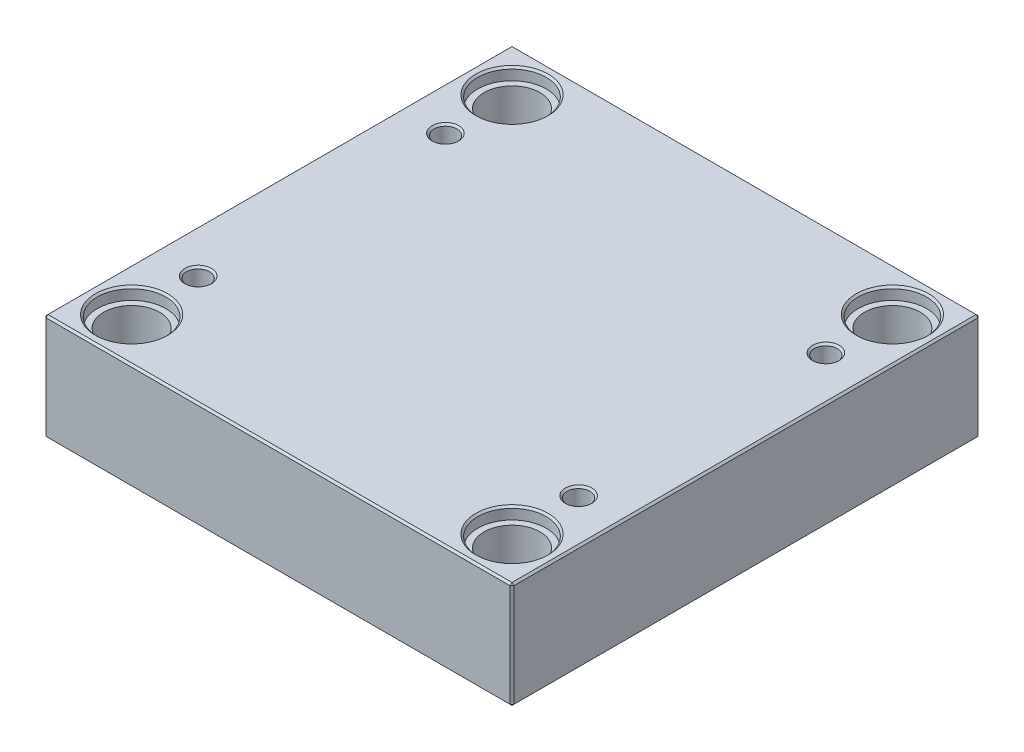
ISO-10303-21;
HEADER;
FILE_DESCRIPTION(('STEP AP214'),'2;1');
FILE_NAME('part.step','',(''),(''),'','','');
FILE_SCHEMA(('AUTOMOTIVE_DESIGN { 1 0 10303 214 1 1 1 1 }'));
ENDSEC;
DATA;
#1=APPLICATION_CONTEXT('core data for automotive mechanical design processes');
#2=APPLICATION_PROTOCOL_DEFINITION('international standard','automotive_design',2000,#1);
#3=PRODUCT_CONTEXT('',#1,'mechanical');
#4=PRODUCT('Part','Part','',(#3));
#5=PRODUCT_RELATED_PRODUCT_CATEGORY('part','',(#4));
#6=PRODUCT_DEFINITION_FORMATION('','',#4);
#7=PRODUCT_DEFINITION_CONTEXT('part definition',#1,'design');
#8=PRODUCT_DEFINITION('design','',#6,#7);
#9=PRODUCT_DEFINITION_SHAPE('','',#8);
#10=(LENGTH_UNIT() NAMED_UNIT(*) SI_UNIT(.MILLI.,.METRE.));
#11=(NAMED_UNIT(*) PLANE_ANGLE_UNIT() SI_UNIT($,.RADIAN.));
#12=(NAMED_UNIT(*) SI_UNIT($,.STERADIAN.) SOLID_ANGLE_UNIT());
#13=UNCERTAINTY_MEASURE_WITH_UNIT(LENGTH_MEASURE(1.E-05),#10,'distance_accuracy_value','');
#14=(GEOMETRIC_REPRESENTATION_CONTEXT(3) GLOBAL_UNCERTAINTY_ASSIGNED_CONTEXT((#13)) GLOBAL_UNIT_ASSIGNED_CONTEXT((#10,
#11,#12)) REPRESENTATION_CONTEXT('',''));
#15=CARTESIAN_POINT('',(0.,0.,0.));
#16=DIRECTION('',(0.,0.,1.));
#17=DIRECTION('',(1.,0.,0.));
#18=AXIS2_PLACEMENT_3D('',#15,#16,#17);
#19=CARTESIAN_POINT('',(-100.,0.,-100.));
#20=DIRECTION('',(0.,1.,0.));
#21=DIRECTION('',(0.,0.,1.));
#22=AXIS2_PLACEMENT_3D('',#19,#20,#21);
#23=CYLINDRICAL_SURFACE('',#22,14.7);
#24=CARTESIAN_POINT('',(-100.,0.999999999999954,-100.));
#25=DIRECTION('',(0.,1.,0.));
#26=DIRECTION('',(0.,0.,1.));
#27=AXIS2_PLACEMENT_3D('',#24,#25,#26);
#28=CIRCLE('',#27,14.7);
#29=CARTESIAN_POINT('',(-100.,0.999999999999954,-85.3));
#30=VERTEX_POINT('',#29);
#31=EDGE_CURVE('E472',#30,#30,#28,.F.);
#32=ORIENTED_EDGE('',*,*,#31,.T.);
#33=EDGE_LOOP('',(#32));
#34=FACE_BOUND('',#33,.T.);
#35=CARTESIAN_POINT('',(-100.,49.7,-100.));
#36=DIRECTION('',(0.,1.,0.));
#37=DIRECTION('',(0.,0.,1.));
#38=AXIS2_PLACEMENT_3D('',#35,#36,#37);
#39=CIRCLE('',#38,14.7);
#40=CARTESIAN_POINT('',(-100.,49.7,-85.3));
#41=VERTEX_POINT('',#40);
#42=EDGE_CURVE('E221',#41,#41,#39,.F.);
#43=ORIENTED_EDGE('',*,*,#42,.F.);
#44=EDGE_LOOP('',(#43));
#45=FACE_BOUND('',#44,.T.);
#46=ADVANCED_FACE('F16',(#34,#45),#23,.F.);
#47=CARTESIAN_POINT('',(100.,0.,-100.));
#48=DIRECTION('',(0.,1.,0.));
#49=DIRECTION('',(0.,0.,1.));
#50=AXIS2_PLACEMENT_3D('',#47,#48,#49);
#51=CYLINDRICAL_SURFACE('',#50,14.7);
#52=CARTESIAN_POINT('',(100.,0.999999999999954,-100.));
#53=DIRECTION('',(0.,1.,0.));
#54=DIRECTION('',(0.,0.,1.));
#55=AXIS2_PLACEMENT_3D('',#52,#53,#54);
#56=CIRCLE('',#55,14.7);
#57=CARTESIAN_POINT('',(100.,0.999999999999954,-85.3));
#58=VERTEX_POINT('',#57);
#59=EDGE_CURVE('E474',#58,#58,#56,.F.);
#60=ORIENTED_EDGE('',*,*,#59,.T.);
#61=EDGE_LOOP('',(#60));
#62=FACE_BOUND('',#61,.T.);
#63=CARTESIAN_POINT('',(100.,49.7,-100.));
#64=DIRECTION('',(0.,1.,0.));
#65=DIRECTION('',(0.,0.,1.));
#66=AXIS2_PLACEMENT_3D('',#63,#64,#65);
#67=CIRCLE('',#66,14.7);
#68=CARTESIAN_POINT('',(100.,49.7,-85.3));
#69=VERTEX_POINT('',#68);
#70=EDGE_CURVE('E218',#69,#69,#67,.F.);
#71=ORIENTED_EDGE('',*,*,#70,.F.);
#72=EDGE_LOOP('',(#71));
#73=FACE_BOUND('',#72,.T.);
#74=ADVANCED_FACE('F263',(#62,#73),#51,.F.);
#75=CARTESIAN_POINT('',(100.,0.,100.));
#76=DIRECTION('',(0.,1.,0.));
#77=DIRECTION('',(0.,0.,1.));
#78=AXIS2_PLACEMENT_3D('',#75,#76,#77);
#79=CYLINDRICAL_SURFACE('',#78,14.7);
#80=CARTESIAN_POINT('',(100.,1.00000000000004,100.));
#81=DIRECTION('',(0.,1.,0.));
#82=DIRECTION('',(0.,0.,1.));
#83=AXIS2_PLACEMENT_3D('',#80,#81,#82);
#84=CIRCLE('',#83,14.7);
#85=CARTESIAN_POINT('',(100.,1.00000000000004,114.7));
#86=VERTEX_POINT('',#85);
#87=EDGE_CURVE('E477',#86,#86,#84,.F.);
#88=ORIENTED_EDGE('',*,*,#87,.T.);
#89=EDGE_LOOP('',(#88));
#90=FACE_BOUND('',#89,.T.);
#91=CARTESIAN_POINT('',(100.,49.7,100.));
#92=DIRECTION('',(0.,1.,0.));
#93=DIRECTION('',(0.,0.,1.));
#94=AXIS2_PLACEMENT_3D('',#91,#92,#93);
#95=CIRCLE('',#94,14.7);
#96=CARTESIAN_POINT('',(100.,49.7,114.7));
#97=VERTEX_POINT('',#96);
#98=EDGE_CURVE('E214',#97,#97,#95,.F.);
#99=ORIENTED_EDGE('',*,*,#98,.F.);
#100=EDGE_LOOP('',(#99));
#101=FACE_BOUND('',#100,.T.);
#102=ADVANCED_FACE('F270',(#90,#101),#79,.F.);
#103=CARTESIAN_POINT('',(-100.,0.,100.));
#104=DIRECTION('',(0.,1.,0.));
#105=DIRECTION('',(0.,0.,1.));
#106=AXIS2_PLACEMENT_3D('',#103,#104,#105);
#107=CYLINDRICAL_SURFACE('',#106,14.7);
#108=CARTESIAN_POINT('',(-100.,1.00000000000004,100.));
#109=DIRECTION('',(0.,1.,0.));
#110=DIRECTION('',(0.,0.,1.));
#111=AXIS2_PLACEMENT_3D('',#108,#109,#110);
#112=CIRCLE('',#111,14.7);
#113=CARTESIAN_POINT('',(-100.,1.00000000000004,114.7));
#114=VERTEX_POINT('',#113);
#115=EDGE_CURVE('E480',#114,#114,#112,.F.);
#116=ORIENTED_EDGE('',*,*,#115,.T.);
#117=EDGE_LOOP('',(#116));
#118=FACE_BOUND('',#117,.T.);
#119=CARTESIAN_POINT('',(-100.,49.7,100.));
#120=DIRECTION('',(0.,1.,0.));
#121=DIRECTION('',(0.,0.,1.));
#122=AXIS2_PLACEMENT_3D('',#119,#120,#121);
#123=CIRCLE('',#122,14.7);
#124=CARTESIAN_POINT('',(-100.,49.7,114.7));
#125=VERTEX_POINT('',#124);
#126=EDGE_CURVE('E211',#125,#125,#123,.F.);
#127=ORIENTED_EDGE('',*,*,#126,.F.);
#128=EDGE_LOOP('',(#127));
#129=FACE_BOUND('',#128,.T.);
#130=ADVANCED_FACE('F277',(#118,#129),#107,.F.);
#131=CARTESIAN_POINT('',(-123.,56.,123.));
#132=DIRECTION('',(1.,0.,0.));
#133=DIRECTION('',(0.,0.,-1.));
#134=AXIS2_PLACEMENT_3D('',#131,#132,#133);
#135=PLANE('',#134);
#136=DIRECTION('',(0.,-1.,0.));
#137=VECTOR('',#136,1.);
#138=CARTESIAN_POINT('',(-123.,56.,-122.));
#139=LINE('',#138,#137);
#140=CARTESIAN_POINT('',(-123.,55.,-122.));
#141=VERTEX_POINT('',#140);
#142=CARTESIAN_POINT('',(-123.,1.,-122.));
#143=VERTEX_POINT('',#142);
#144=EDGE_CURVE('E487',#141,#143,#139,.T.);
#145=ORIENTED_EDGE('',*,*,#144,.T.);
#146=DIRECTION('',(0.,0.,1.));
#147=VECTOR('',#146,1.);
#148=CARTESIAN_POINT('',(-123.,1.,123.));
#149=LINE('',#148,#147);
#150=CARTESIAN_POINT('',(-123.,1.,122.));
#151=VERTEX_POINT('',#150);
#152=EDGE_CURVE('E490',#143,#151,#149,.T.);
#153=ORIENTED_EDGE('',*,*,#152,.T.);
#154=DIRECTION('',(0.,1.,0.));
#155=VECTOR('',#154,1.);
#156=CARTESIAN_POINT('',(-123.,56.,122.));
#157=LINE('',#156,#155);
#158=CARTESIAN_POINT('',(-123.,55.,122.));
#159=VERTEX_POINT('',#158);
#160=EDGE_CURVE('E485',#151,#159,#157,.T.);
#161=ORIENTED_EDGE('',*,*,#160,.T.);
#162=DIRECTION('',(0.,0.,-1.));
#163=VECTOR('',#162,1.);
#164=CARTESIAN_POINT('',(-123.,55.,-123.));
#165=LINE('',#164,#163);
#166=EDGE_CURVE('E483',#159,#141,#165,.T.);
#167=ORIENTED_EDGE('',*,*,#166,.T.);
#168=EDGE_LOOP('',(#145,#153,#161,#167));
#169=FACE_BOUND('',#168,.T.);
#170=ADVANCED_FACE('F298',(#169),#135,.F.);
#171=CARTESIAN_POINT('',(123.,56.,123.));
#172=DIRECTION('',(0.,0.,-1.));
#173=DIRECTION('',(-1.,0.,0.));
#174=AXIS2_PLACEMENT_3D('',#171,#172,#173);
#175=PLANE('',#174);
#176=DIRECTION('',(-1.,0.,0.));
#177=VECTOR('',#176,1.);
#178=CARTESIAN_POINT('',(-123.,55.,123.));
#179=LINE('',#178,#177);
#180=CARTESIAN_POINT('',(122.,55.,123.));
#181=VERTEX_POINT('',#180);
#182=CARTESIAN_POINT('',(-122.,55.,123.));
#183=VERTEX_POINT('',#182);
#184=EDGE_CURVE('E509',#181,#183,#179,.T.);
#185=ORIENTED_EDGE('',*,*,#184,.T.);
#186=DIRECTION('',(0.,-1.,0.));
#187=VECTOR('',#186,1.);
#188=CARTESIAN_POINT('',(-122.,56.,123.));
#189=LINE('',#188,#187);
#190=CARTESIAN_POINT('',(-122.,1.00000000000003,123.));
#191=VERTEX_POINT('',#190);
#192=EDGE_CURVE('E515',#183,#191,#189,.T.);
#193=ORIENTED_EDGE('',*,*,#192,.T.);
#194=DIRECTION('',(1.,0.,0.));
#195=VECTOR('',#194,1.);
#196=CARTESIAN_POINT('',(123.,1.00000000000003,123.));
#197=LINE('',#196,#195);
#198=CARTESIAN_POINT('',(122.,1.00000000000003,123.));
#199=VERTEX_POINT('',#198);
#200=EDGE_CURVE('E513',#191,#199,#197,.T.);
#201=ORIENTED_EDGE('',*,*,#200,.T.);
#202=DIRECTION('',(0.,1.,0.));
#203=VECTOR('',#202,1.);
#204=CARTESIAN_POINT('',(122.,56.,123.));
#205=LINE('',#204,#203);
#206=EDGE_CURVE('E511',#199,#181,#205,.T.);
#207=ORIENTED_EDGE('',*,*,#206,.T.);
#208=EDGE_LOOP('',(#185,#193,#201,#207));
#209=FACE_BOUND('',#208,.T.);
#210=ADVANCED_FACE('F294',(#209),#175,.F.);
#211=CARTESIAN_POINT('',(123.,56.,123.));
#212=DIRECTION('',(-1.,0.,0.));
#213=DIRECTION('',(0.,0.,1.));
#214=AXIS2_PLACEMENT_3D('',#211,#212,#213);
#215=PLANE('',#214);
#216=DIRECTION('',(0.,0.,-1.));
#217=VECTOR('',#216,1.);
#218=CARTESIAN_POINT('',(123.,1.00000000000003,123.));
#219=LINE('',#218,#217);
#220=CARTESIAN_POINT('',(123.,1.00000000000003,122.));
#221=VERTEX_POINT('',#220);
#222=CARTESIAN_POINT('',(123.,1.00000000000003,-122.));
#223=VERTEX_POINT('',#222);
#224=EDGE_CURVE('E504',#221,#223,#219,.T.);
#225=ORIENTED_EDGE('',*,*,#224,.T.);
#226=DIRECTION('',(0.,1.,0.));
#227=VECTOR('',#226,1.);
#228=CARTESIAN_POINT('',(123.,56.,-122.));
#229=LINE('',#228,#227);
#230=CARTESIAN_POINT('',(123.,55.,-122.));
#231=VERTEX_POINT('',#230);
#232=EDGE_CURVE('E506',#223,#231,#229,.T.);
#233=ORIENTED_EDGE('',*,*,#232,.T.);
#234=DIRECTION('',(0.,0.,1.));
#235=VECTOR('',#234,1.);
#236=CARTESIAN_POINT('',(123.,55.,123.));
#237=LINE('',#236,#235);
#238=CARTESIAN_POINT('',(123.,55.,122.));
#239=VERTEX_POINT('',#238);
#240=EDGE_CURVE('E500',#231,#239,#237,.T.);
#241=ORIENTED_EDGE('',*,*,#240,.T.);
#242=DIRECTION('',(0.,-1.,0.));
#243=VECTOR('',#242,1.);
#244=CARTESIAN_POINT('',(123.,56.,122.));
#245=LINE('',#244,#243);
#246=EDGE_CURVE('E502',#239,#221,#245,.T.);
#247=ORIENTED_EDGE('',*,*,#246,.T.);
#248=EDGE_LOOP('',(#225,#233,#241,#247));
#249=FACE_BOUND('',#248,.T.);
#250=ADVANCED_FACE('F290',(#249),#215,.F.);
#251=CARTESIAN_POINT('',(123.,56.,-123.));
#252=DIRECTION('',(0.,0.,1.));
#253=DIRECTION('',(1.,0.,0.));
#254=AXIS2_PLACEMENT_3D('',#251,#252,#253);
#255=PLANE('',#254);
#256=DIRECTION('',(0.,-1.,0.));
#257=VECTOR('',#256,1.);
#258=CARTESIAN_POINT('',(122.,56.,-123.));
#259=LINE('',#258,#257);
#260=CARTESIAN_POINT('',(122.,55.,-123.));
#261=VERTEX_POINT('',#260);
#262=CARTESIAN_POINT('',(122.,1.00000000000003,-123.));
#263=VERTEX_POINT('',#262);
#264=EDGE_CURVE('E494',#261,#263,#259,.T.);
#265=ORIENTED_EDGE('',*,*,#264,.T.);
#266=DIRECTION('',(-1.,0.,0.));
#267=VECTOR('',#266,1.);
#268=CARTESIAN_POINT('',(123.,1.00000000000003,-123.));
#269=LINE('',#268,#267);
#270=CARTESIAN_POINT('',(-122.,1.00000000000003,-123.));
#271=VERTEX_POINT('',#270);
#272=EDGE_CURVE('E138',#263,#271,#269,.T.);
#273=ORIENTED_EDGE('',*,*,#272,.T.);
#274=DIRECTION('',(0.,1.,0.));
#275=VECTOR('',#274,1.);
#276=CARTESIAN_POINT('',(-122.,56.,-123.));
#277=LINE('',#276,#275);
#278=CARTESIAN_POINT('',(-122.,55.,-123.));
#279=VERTEX_POINT('',#278);
#280=EDGE_CURVE('E496',#271,#279,#277,.T.);
#281=ORIENTED_EDGE('',*,*,#280,.T.);
#282=DIRECTION('',(1.,0.,0.));
#283=VECTOR('',#282,1.);
#284=CARTESIAN_POINT('',(123.,55.,-123.));
#285=LINE('',#284,#283);
#286=EDGE_CURVE('E492',#279,#261,#285,.T.);
#287=ORIENTED_EDGE('',*,*,#286,.T.);
#288=EDGE_LOOP('',(#265,#273,#281,#287));
#289=FACE_BOUND('',#288,.T.);
#290=ADVANCED_FACE('F282',(#289),#255,.F.);
#291=CARTESIAN_POINT('',(0.,56.,0.));
#292=DIRECTION('',(0.,1.,0.));
#293=DIRECTION('',(0.,0.,1.));
#294=AXIS2_PLACEMENT_3D('',#291,#292,#293);
#295=PLANE('',#294);
#296=CARTESIAN_POINT('',(100.,56.,100.));
#297=DIRECTION('',(0.,1.,0.));
#298=DIRECTION('',(0.,0.,1.));
#299=AXIS2_PLACEMENT_3D('',#296,#297,#298);
#300=CIRCLE('',#299,19.);
#301=CARTESIAN_POINT('',(100.,56.,119.));
#302=VERTEX_POINT('',#301);
#303=EDGE_CURVE('E236',#302,#302,#300,.F.);
#304=ORIENTED_EDGE('',*,*,#303,.T.);
#305=EDGE_LOOP('',(#304));
#306=FACE_BOUND('',#305,.T.);
#307=CARTESIAN_POINT('',(-100.,56.,100.));
#308=DIRECTION('',(0.,1.,0.));
#309=DIRECTION('',(0.,0.,1.));
#310=AXIS2_PLACEMENT_3D('',#307,#308,#309);
#311=CIRCLE('',#310,19.);
#312=CARTESIAN_POINT('',(-100.,56.,119.));
#313=VERTEX_POINT('',#312);
#314=EDGE_CURVE('E233',#313,#313,#311,.F.);
#315=ORIENTED_EDGE('',*,*,#314,.T.);
#316=EDGE_LOOP('',(#315));
#317=FACE_BOUND('',#316,.T.);
#318=CARTESIAN_POINT('',(100.,56.,-100.));
#319=DIRECTION('',(0.,1.,0.));
#320=DIRECTION('',(0.,0.,1.));
#321=AXIS2_PLACEMENT_3D('',#318,#319,#320);
#322=CIRCLE('',#321,19.);
#323=CARTESIAN_POINT('',(100.,56.,-81.));
#324=VERTEX_POINT('',#323);
#325=EDGE_CURVE('E230',#324,#324,#322,.F.);
#326=ORIENTED_EDGE('',*,*,#325,.T.);
#327=EDGE_LOOP('',(#326));
#328=FACE_BOUND('',#327,.T.);
#329=CARTESIAN_POINT('',(-100.,56.,-100.));
#330=DIRECTION('',(0.,1.,0.));
#331=DIRECTION('',(0.,0.,1.));
#332=AXIS2_PLACEMENT_3D('',#329,#330,#331);
#333=CIRCLE('',#332,19.);
#334=CARTESIAN_POINT('',(-100.,56.,-81.));
#335=VERTEX_POINT('',#334);
#336=EDGE_CURVE('E227',#335,#335,#333,.F.);
#337=ORIENTED_EDGE('',*,*,#336,.T.);
#338=EDGE_LOOP('',(#337));
#339=FACE_BOUND('',#338,.T.);
#340=CARTESIAN_POINT('',(-100.,56.,65.));
#341=DIRECTION('',(0.,1.,0.));
#342=DIRECTION('',(0.,0.,1.));
#343=AXIS2_PLACEMENT_3D('',#340,#341,#342);
#344=CIRCLE('',#343,7.);
#345=CARTESIAN_POINT('',(-100.,56.,72.));
#346=VERTEX_POINT('',#345);
#347=EDGE_CURVE('E198',#346,#346,#344,.F.);
#348=ORIENTED_EDGE('',*,*,#347,.T.);
#349=EDGE_LOOP('',(#348));
#350=FACE_BOUND('',#349,.T.);
#351=CARTESIAN_POINT('',(100.,56.,65.));
#352=DIRECTION('',(0.,1.,0.));
#353=DIRECTION('',(0.,0.,1.));
#354=AXIS2_PLACEMENT_3D('',#351,#352,#353);
#355=CIRCLE('',#354,7.);
#356=CARTESIAN_POINT('',(100.,56.,72.));
#357=VERTEX_POINT('',#356);
#358=EDGE_CURVE('E195',#357,#357,#355,.F.);
#359=ORIENTED_EDGE('',*,*,#358,.T.);
#360=EDGE_LOOP('',(#359));
#361=FACE_BOUND('',#360,.T.);
#362=CARTESIAN_POINT('',(100.,56.,-65.));
#363=DIRECTION('',(0.,1.,0.));
#364=DIRECTION('',(0.,0.,1.));
#365=AXIS2_PLACEMENT_3D('',#362,#363,#364);
#366=CIRCLE('',#365,7.);
#367=CARTESIAN_POINT('',(100.,56.,-58.));
#368=VERTEX_POINT('',#367);
#369=EDGE_CURVE('E192',#368,#368,#366,.F.);
#370=ORIENTED_EDGE('',*,*,#369,.T.);
#371=EDGE_LOOP('',(#370));
#372=FACE_BOUND('',#371,.T.);
#373=CARTESIAN_POINT('',(-100.,56.,-65.));
#374=DIRECTION('',(0.,1.,0.));
#375=DIRECTION('',(0.,0.,1.));
#376=AXIS2_PLACEMENT_3D('',#373,#374,#375);
#377=CIRCLE('',#376,7.);
#378=CARTESIAN_POINT('',(-100.,56.,-58.));
#379=VERTEX_POINT('',#378);
#380=EDGE_CURVE('E188',#379,#379,#377,.F.);
#381=ORIENTED_EDGE('',*,*,#380,.T.);
#382=EDGE_LOOP('',(#381));
#383=FACE_BOUND('',#382,.T.);
#384=DIRECTION('',(0.,0.,-1.));
#385=VECTOR('',#384,1.);
#386=CARTESIAN_POINT('',(122.,56.,-123.));
#387=LINE('',#386,#385);
#388=CARTESIAN_POINT('',(122.,56.,122.));
#389=VERTEX_POINT('',#388);
#390=CARTESIAN_POINT('',(122.,56.,-122.));
#391=VERTEX_POINT('',#390);
#392=EDGE_CURVE('E31',#389,#391,#387,.T.);
#393=ORIENTED_EDGE('',*,*,#392,.T.);
#394=DIRECTION('',(-1.,0.,0.));
#395=VECTOR('',#394,1.);
#396=CARTESIAN_POINT('',(-123.,56.,-122.));
#397=LINE('',#396,#395);
#398=CARTESIAN_POINT('',(-122.,56.,-122.));
#399=VERTEX_POINT('',#398);
#400=EDGE_CURVE('E189',#391,#399,#397,.T.);
#401=ORIENTED_EDGE('',*,*,#400,.T.);
#402=DIRECTION('',(0.,0.,1.));
#403=VECTOR('',#402,1.);
#404=CARTESIAN_POINT('',(-122.,56.,123.));
#405=LINE('',#404,#403);
#406=CARTESIAN_POINT('',(-122.,56.,122.));
#407=VERTEX_POINT('',#406);
#408=EDGE_CURVE('E518',#399,#407,#405,.T.);
#409=ORIENTED_EDGE('',*,*,#408,.T.);
#410=DIRECTION('',(1.,0.,0.));
#411=VECTOR('',#410,1.);
#412=CARTESIAN_POINT('',(123.,56.,122.));
#413=LINE('',#412,#411);
#414=EDGE_CURVE('E36',#407,#389,#413,.T.);
#415=ORIENTED_EDGE('',*,*,#414,.T.);
#416=EDGE_LOOP('',(#393,#401,#409,#415));
#417=FACE_BOUND('',#416,.T.);
#418=ADVANCED_FACE('F279',(#306,#317,#328,#339,#350,#361,#372,#383,#417),#295,.T.);
#419=CARTESIAN_POINT('',(0.,0.,0.));
#420=DIRECTION('',(0.,1.,0.));
#421=DIRECTION('',(0.,0.,1.));
#422=AXIS2_PLACEMENT_3D('',#419,#420,#421);
#423=PLANE('',#422);
#424=CARTESIAN_POINT('',(-100.,0.,-100.));
#425=DIRECTION('',(0.,1.,0.));
#426=DIRECTION('',(0.,0.,1.));
#427=AXIS2_PLACEMENT_3D('',#424,#425,#426);
#428=CIRCLE('',#427,15.7);
#429=CARTESIAN_POINT('',(-100.,0.,-84.3));
#430=VERTEX_POINT('',#429);
#431=EDGE_CURVE('E469',#430,#430,#428,.T.);
#432=ORIENTED_EDGE('',*,*,#431,.T.);
#433=EDGE_LOOP('',(#432));
#434=FACE_BOUND('',#433,.T.);
#435=CARTESIAN_POINT('',(100.,0.,-100.));
#436=DIRECTION('',(0.,1.,0.));
#437=DIRECTION('',(0.,0.,1.));
#438=AXIS2_PLACEMENT_3D('',#435,#436,#437);
#439=CIRCLE('',#438,15.7);
#440=CARTESIAN_POINT('',(100.,0.,-84.3));
#441=VERTEX_POINT('',#440);
#442=EDGE_CURVE('E466',#441,#441,#439,.T.);
#443=ORIENTED_EDGE('',*,*,#442,.T.);
#444=EDGE_LOOP('',(#443));
#445=FACE_BOUND('',#444,.T.);
#446=CARTESIAN_POINT('',(100.,0.,100.));
#447=DIRECTION('',(0.,1.,0.));
#448=DIRECTION('',(0.,0.,1.));
#449=AXIS2_PLACEMENT_3D('',#446,#447,#448);
#450=CIRCLE('',#449,15.7);
#451=CARTESIAN_POINT('',(100.,0.,115.7));
#452=VERTEX_POINT('',#451);
#453=EDGE_CURVE('E463',#452,#452,#450,.T.);
#454=ORIENTED_EDGE('',*,*,#453,.T.);
#455=EDGE_LOOP('',(#454));
#456=FACE_BOUND('',#455,.T.);
#457=CARTESIAN_POINT('',(-100.,0.,100.));
#458=DIRECTION('',(0.,1.,0.));
#459=DIRECTION('',(0.,0.,1.));
#460=AXIS2_PLACEMENT_3D('',#457,#458,#459);
#461=CIRCLE('',#460,15.7);
#462=CARTESIAN_POINT('',(-100.,0.,115.7));
#463=VERTEX_POINT('',#462);
#464=EDGE_CURVE('E460',#463,#463,#461,.T.);
#465=ORIENTED_EDGE('',*,*,#464,.T.);
#466=EDGE_LOOP('',(#465));
#467=FACE_BOUND('',#466,.T.);
#468=DIRECTION('',(0.,0.,1.));
#469=VECTOR('',#468,1.);
#470=CARTESIAN_POINT('',(122.,0.,0.));
#471=LINE('',#470,#469);
#472=CARTESIAN_POINT('',(122.,0.,-122.));
#473=VERTEX_POINT('',#472);
#474=CARTESIAN_POINT('',(122.,0.,122.));
#475=VERTEX_POINT('',#474);
#476=EDGE_CURVE('E108',#473,#475,#471,.T.);
#477=ORIENTED_EDGE('',*,*,#476,.T.);
#478=DIRECTION('',(-1.,0.,0.));
#479=VECTOR('',#478,1.);
#480=CARTESIAN_POINT('',(0.,0.,122.));
#481=LINE('',#480,#479);
#482=CARTESIAN_POINT('',(-122.,0.,122.));
#483=VERTEX_POINT('',#482);
#484=EDGE_CURVE('E458',#475,#483,#481,.T.);
#485=ORIENTED_EDGE('',*,*,#484,.T.);
#486=DIRECTION('',(0.,0.,-1.));
#487=VECTOR('',#486,1.);
#488=CARTESIAN_POINT('',(-122.,0.,0.));
#489=LINE('',#488,#487);
#490=CARTESIAN_POINT('',(-122.,0.,-122.));
#491=VERTEX_POINT('',#490);
#492=EDGE_CURVE('E110',#483,#491,#489,.T.);
#493=ORIENTED_EDGE('',*,*,#492,.T.);
#494=DIRECTION('',(1.,0.,0.));
#495=VECTOR('',#494,1.);
#496=CARTESIAN_POINT('',(0.,0.,-122.));
#497=LINE('',#496,#495);
#498=EDGE_CURVE('E104',#491,#473,#497,.T.);
#499=ORIENTED_EDGE('',*,*,#498,.T.);
#500=EDGE_LOOP('',(#477,#485,#493,#499));
#501=FACE_BOUND('',#500,.T.);
#502=ADVANCED_FACE('F106',(#434,#445,#456,#467,#501),#423,.F.);
#503=CARTESIAN_POINT('',(-100.,0.,-100.));
#504=DIRECTION('',(0.,-1.,0.));
#505=DIRECTION('',(0.,0.,-1.));
#506=AXIS2_PLACEMENT_3D('',#503,#504,#505);
#507=CONICAL_SURFACE('',#506,15.7,0.785398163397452);
#508=ORIENTED_EDGE('',*,*,#31,.F.);
#509=EDGE_LOOP('',(#508));
#510=FACE_BOUND('',#509,.T.);
#511=ORIENTED_EDGE('',*,*,#431,.F.);
#512=EDGE_LOOP('',(#511));
#513=FACE_BOUND('',#512,.T.);
#514=ADVANCED_FACE('F286',(#510,#513),#507,.F.);
#515=CARTESIAN_POINT('',(100.,0.,-100.));
#516=DIRECTION('',(0.,-1.,0.));
#517=DIRECTION('',(0.,0.,-1.));
#518=AXIS2_PLACEMENT_3D('',#515,#516,#517);
#519=CONICAL_SURFACE('',#518,15.7,0.785398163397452);
#520=ORIENTED_EDGE('',*,*,#59,.F.);
#521=EDGE_LOOP('',(#520));
#522=FACE_BOUND('',#521,.T.);
#523=ORIENTED_EDGE('',*,*,#442,.F.);
#524=EDGE_LOOP('',(#523));
#525=FACE_BOUND('',#524,.T.);
#526=ADVANCED_FACE('F305',(#522,#525),#519,.F.);
#527=CARTESIAN_POINT('',(100.,0.,100.));
#528=DIRECTION('',(0.,-1.,0.));
#529=DIRECTION('',(0.,0.,-1.));
#530=AXIS2_PLACEMENT_3D('',#527,#528,#529);
#531=CONICAL_SURFACE('',#530,15.7,0.785398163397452);
#532=ORIENTED_EDGE('',*,*,#87,.F.);
#533=EDGE_LOOP('',(#532));
#534=FACE_BOUND('',#533,.T.);
#535=ORIENTED_EDGE('',*,*,#453,.F.);
#536=EDGE_LOOP('',(#535));
#537=FACE_BOUND('',#536,.T.);
#538=ADVANCED_FACE('F309',(#534,#537),#531,.F.);
#539=CARTESIAN_POINT('',(-100.,0.,100.));
#540=DIRECTION('',(0.,-1.,0.));
#541=DIRECTION('',(0.,0.,-1.));
#542=AXIS2_PLACEMENT_3D('',#539,#540,#541);
#543=CONICAL_SURFACE('',#542,15.7,0.785398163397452);
#544=ORIENTED_EDGE('',*,*,#115,.F.);
#545=EDGE_LOOP('',(#544));
#546=FACE_BOUND('',#545,.T.);
#547=ORIENTED_EDGE('',*,*,#464,.F.);
#548=EDGE_LOOP('',(#547));
#549=FACE_BOUND('',#548,.T.);
#550=ADVANCED_FACE('F313',(#546,#549),#543,.F.);
#551=CARTESIAN_POINT('',(123.,56.,122.));
#552=DIRECTION('',(-0.707106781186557,0.,-0.707106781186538));
#553=DIRECTION('',(0.,-1.,0.));
#554=AXIS2_PLACEMENT_3D('',#551,#552,#553);
#555=PLANE('',#554);
#556=DIRECTION('',(-0.707106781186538,0.,0.707106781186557));
#557=VECTOR('',#556,1.);
#558=CARTESIAN_POINT('',(122.,55.,123.));
#559=LINE('',#558,#557);
#560=EDGE_CURVE('E126',#181,#239,#559,.F.);
#561=ORIENTED_EDGE('',*,*,#560,.F.);
#562=ORIENTED_EDGE('',*,*,#206,.F.);
#563=DIRECTION('',(0.707106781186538,0.,-0.707106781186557));
#564=VECTOR('',#563,1.);
#565=CARTESIAN_POINT('',(122.,1.00000000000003,123.));
#566=LINE('',#565,#564);
#567=EDGE_CURVE('E180',#221,#199,#566,.F.);
#568=ORIENTED_EDGE('',*,*,#567,.F.);
#569=ORIENTED_EDGE('',*,*,#246,.F.);
#570=EDGE_LOOP('',(#561,#562,#568,#569));
#571=FACE_BOUND('',#570,.T.);
#572=ADVANCED_FACE('F317',(#571),#555,.F.);
#573=CARTESIAN_POINT('',(122.,55.,123.));
#574=DIRECTION('',(0.577350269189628,0.577350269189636,0.577350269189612));
#575=DIRECTION('',(-0.707106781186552,0.707106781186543,0.));
#576=AXIS2_PLACEMENT_3D('',#573,#574,#575);
#577=PLANE('',#576);
#578=DIRECTION('',(0.,-0.70710678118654,0.707106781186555));
#579=VECTOR('',#578,1.);
#580=CARTESIAN_POINT('',(122.,55.,123.));
#581=LINE('',#580,#579);
#582=EDGE_CURVE('E175',#181,#389,#581,.F.);
#583=ORIENTED_EDGE('',*,*,#582,.F.);
#584=ORIENTED_EDGE('',*,*,#560,.T.);
#585=DIRECTION('',(-0.707106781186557,0.707106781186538,0.));
#586=VECTOR('',#585,1.);
#587=CARTESIAN_POINT('',(122.5,55.5,122.));
#588=LINE('',#587,#586);
#589=EDGE_CURVE('E177',#389,#239,#588,.F.);
#590=ORIENTED_EDGE('',*,*,#589,.F.);
#591=EDGE_LOOP('',(#583,#584,#590));
#592=FACE_BOUND('',#591,.T.);
#593=ADVANCED_FACE('F385',(#592),#577,.T.);
#594=CARTESIAN_POINT('',(122.,1.00000000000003,123.));
#595=DIRECTION('',(0.577350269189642,-0.57735026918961,0.577350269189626));
#596=DIRECTION('',(0.707106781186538,0.,-0.707106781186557));
#597=AXIS2_PLACEMENT_3D('',#594,#595,#596);
#598=PLANE('',#597);
#599=DIRECTION('',(-0.707106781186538,-0.707106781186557,0.));
#600=VECTOR('',#599,1.);
#601=CARTESIAN_POINT('',(122.5,0.500000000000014,122.));
#602=LINE('',#601,#600);
#603=EDGE_CURVE('E124',#221,#475,#602,.T.);
#604=ORIENTED_EDGE('',*,*,#603,.F.);
#605=ORIENTED_EDGE('',*,*,#567,.T.);
#606=DIRECTION('',(0.,0.70710678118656,0.707106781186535));
#607=VECTOR('',#606,1.);
#608=CARTESIAN_POINT('',(122.,1.00000000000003,123.));
#609=LINE('',#608,#607);
#610=EDGE_CURVE('E172',#475,#199,#609,.T.);
#611=ORIENTED_EDGE('',*,*,#610,.F.);
#612=EDGE_LOOP('',(#604,#605,#611));
#613=FACE_BOUND('',#612,.T.);
#614=ADVANCED_FACE('F381',(#613),#598,.T.);
#615=CARTESIAN_POINT('',(122.,56.,0.));
#616=DIRECTION('',(0.707106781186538,0.707106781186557,0.));
#617=DIRECTION('',(0.,0.,1.));
#618=AXIS2_PLACEMENT_3D('',#615,#616,#617);
#619=PLANE('',#618);
#620=ORIENTED_EDGE('',*,*,#589,.T.);
#621=ORIENTED_EDGE('',*,*,#240,.F.);
#622=DIRECTION('',(0.707106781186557,-0.707106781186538,0.));
#623=VECTOR('',#622,1.);
#624=CARTESIAN_POINT('',(123.,55.,-122.));
#625=LINE('',#624,#623);
#626=EDGE_CURVE('E166',#391,#231,#625,.T.);
#627=ORIENTED_EDGE('',*,*,#626,.F.);
#628=ORIENTED_EDGE('',*,*,#392,.F.);
#629=EDGE_LOOP('',(#620,#621,#627,#628));
#630=FACE_BOUND('',#629,.T.);
#631=ADVANCED_FACE('F377',(#630),#619,.T.);
#632=CARTESIAN_POINT('',(0.,56.,122.));
#633=DIRECTION('',(0.,0.707106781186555,0.70710678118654));
#634=DIRECTION('',(-1.,0.,0.));
#635=AXIS2_PLACEMENT_3D('',#632,#633,#634);
#636=PLANE('',#635);
#637=ORIENTED_EDGE('',*,*,#582,.T.);
#638=ORIENTED_EDGE('',*,*,#414,.F.);
#639=DIRECTION('',(0.,0.70710678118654,-0.707106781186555));
#640=VECTOR('',#639,1.);
#641=CARTESIAN_POINT('',(-122.,55.5,122.5));
#642=LINE('',#641,#640);
#643=EDGE_CURVE('E163',#183,#407,#642,.T.);
#644=ORIENTED_EDGE('',*,*,#643,.F.);
#645=ORIENTED_EDGE('',*,*,#184,.F.);
#646=EDGE_LOOP('',(#637,#638,#644,#645));
#647=FACE_BOUND('',#646,.T.);
#648=ADVANCED_FACE('F373',(#647),#636,.T.);
#649=CARTESIAN_POINT('',(-122.,56.,123.));
#650=DIRECTION('',(0.707106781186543,0.,-0.707106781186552));
#651=DIRECTION('',(0.,-1.,0.));
#652=AXIS2_PLACEMENT_3D('',#649,#650,#651);
#653=PLANE('',#652);
#654=DIRECTION('',(0.707106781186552,0.,0.707106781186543));
#655=VECTOR('',#654,1.);
#656=CARTESIAN_POINT('',(-122.,1.00000000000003,123.));
#657=LINE('',#656,#655);
#658=EDGE_CURVE('E157',#191,#151,#657,.F.);
#659=ORIENTED_EDGE('',*,*,#658,.F.);
#660=ORIENTED_EDGE('',*,*,#192,.F.);
#661=DIRECTION('',(-0.707106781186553,0.,-0.707106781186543));
#662=VECTOR('',#661,1.);
#663=CARTESIAN_POINT('',(-123.,55.,122.));
#664=LINE('',#663,#662);
#665=EDGE_CURVE('E160',#159,#183,#664,.F.);
#666=ORIENTED_EDGE('',*,*,#665,.F.);
#667=ORIENTED_EDGE('',*,*,#160,.F.);
#668=EDGE_LOOP('',(#659,#660,#666,#667));
#669=FACE_BOUND('',#668,.T.);
#670=ADVANCED_FACE('F369',(#669),#653,.F.);
#671=CARTESIAN_POINT('',(123.,1.00000000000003,123.));
#672=DIRECTION('',(0.,0.707106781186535,-0.70710678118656));
#673=DIRECTION('',(1.,0.,0.));
#674=AXIS2_PLACEMENT_3D('',#671,#672,#673);
#675=PLANE('',#674);
#676=ORIENTED_EDGE('',*,*,#610,.T.);
#677=ORIENTED_EDGE('',*,*,#200,.F.);
#678=DIRECTION('',(0.,-0.70710678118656,-0.707106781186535));
#679=VECTOR('',#678,1.);
#680=CARTESIAN_POINT('',(-122.,1.00000000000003,123.));
#681=LINE('',#680,#679);
#682=EDGE_CURVE('E135',#483,#191,#681,.F.);
#683=ORIENTED_EDGE('',*,*,#682,.F.);
#684=ORIENTED_EDGE('',*,*,#484,.F.);
#685=EDGE_LOOP('',(#676,#677,#683,#684));
#686=FACE_BOUND('',#685,.T.);
#687=ADVANCED_FACE('F366',(#686),#675,.F.);
#688=CARTESIAN_POINT('',(123.,1.00000000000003,123.));
#689=DIRECTION('',(-0.707106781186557,0.707106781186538,0.));
#690=DIRECTION('',(0.,0.,-1.));
#691=AXIS2_PLACEMENT_3D('',#688,#689,#690);
#692=PLANE('',#691);
#693=ORIENTED_EDGE('',*,*,#603,.T.);
#694=ORIENTED_EDGE('',*,*,#476,.F.);
#695=DIRECTION('',(0.707106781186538,0.707106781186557,0.));
#696=VECTOR('',#695,1.);
#697=CARTESIAN_POINT('',(122.5,0.500000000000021,-122.));
#698=LINE('',#697,#696);
#699=EDGE_CURVE('E121',#223,#473,#698,.F.);
#700=ORIENTED_EDGE('',*,*,#699,.F.);
#701=ORIENTED_EDGE('',*,*,#224,.F.);
#702=EDGE_LOOP('',(#693,#694,#700,#701));
#703=FACE_BOUND('',#702,.T.);
#704=ADVANCED_FACE('F119',(#703),#692,.F.);
#705=CARTESIAN_POINT('',(122.,56.,-123.));
#706=DIRECTION('',(-0.707106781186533,0.,0.707106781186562));
#707=DIRECTION('',(0.,-1.,0.));
#708=AXIS2_PLACEMENT_3D('',#705,#706,#707);
#709=PLANE('',#708);
#710=DIRECTION('',(0.707106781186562,0.,0.707106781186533));
#711=VECTOR('',#710,1.);
#712=CARTESIAN_POINT('',(123.,55.,-122.));
#713=LINE('',#712,#711);
#714=EDGE_CURVE('E168',#231,#261,#713,.F.);
#715=ORIENTED_EDGE('',*,*,#714,.F.);
#716=ORIENTED_EDGE('',*,*,#232,.F.);
#717=DIRECTION('',(-0.707106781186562,0.,-0.707106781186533));
#718=VECTOR('',#717,1.);
#719=CARTESIAN_POINT('',(122.,1.00000000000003,-123.));
#720=LINE('',#719,#718);
#721=EDGE_CURVE('E134',#263,#223,#720,.F.);
#722=ORIENTED_EDGE('',*,*,#721,.F.);
#723=ORIENTED_EDGE('',*,*,#264,.F.);
#724=EDGE_LOOP('',(#715,#716,#722,#723));
#725=FACE_BOUND('',#724,.T.);
#726=ADVANCED_FACE('F359',(#725),#709,.F.);
#727=CARTESIAN_POINT('',(123.,55.,-122.));
#728=DIRECTION('',(0.577350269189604,0.577350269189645,-0.577350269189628));
#729=DIRECTION('',(0.,0.707106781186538,0.707106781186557));
#730=AXIS2_PLACEMENT_3D('',#727,#728,#729);
#731=PLANE('',#730);
#732=ORIENTED_EDGE('',*,*,#626,.T.);
#733=ORIENTED_EDGE('',*,*,#714,.T.);
#734=DIRECTION('',(0.,0.707106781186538,0.707106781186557));
#735=VECTOR('',#734,1.);
#736=CARTESIAN_POINT('',(122.,55.5,-122.5));
#737=LINE('',#736,#735);
#738=EDGE_CURVE('E152',#391,#261,#737,.F.);
#739=ORIENTED_EDGE('',*,*,#738,.F.);
#740=EDGE_LOOP('',(#732,#733,#739));
#741=FACE_BOUND('',#740,.T.);
#742=ADVANCED_FACE('F355',(#741),#731,.T.);
#743=CARTESIAN_POINT('',(-123.,55.,122.));
#744=DIRECTION('',(-0.577350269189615,0.577350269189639,0.577350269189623));
#745=DIRECTION('',(0.,-0.707106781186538,0.707106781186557));
#746=AXIS2_PLACEMENT_3D('',#743,#744,#745);
#747=PLANE('',#746);
#748=ORIENTED_EDGE('',*,*,#665,.T.);
#749=ORIENTED_EDGE('',*,*,#643,.T.);
#750=DIRECTION('',(-0.707106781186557,-0.707106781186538,0.));
#751=VECTOR('',#750,1.);
#752=CARTESIAN_POINT('',(-123.,55.,122.));
#753=LINE('',#752,#751);
#754=EDGE_CURVE('E143',#159,#407,#753,.F.);
#755=ORIENTED_EDGE('',*,*,#754,.F.);
#756=EDGE_LOOP('',(#748,#749,#755));
#757=FACE_BOUND('',#756,.T.);
#758=ADVANCED_FACE('F351',(#757),#747,.T.);
#759=CARTESIAN_POINT('',(-122.,1.00000000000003,123.));
#760=DIRECTION('',(-0.577350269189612,-0.577350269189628,0.577350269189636));
#761=DIRECTION('',(0.,-0.707106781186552,-0.707106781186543));
#762=AXIS2_PLACEMENT_3D('',#759,#760,#761);
#763=PLANE('',#762);
#764=ORIENTED_EDGE('',*,*,#682,.T.);
#765=ORIENTED_EDGE('',*,*,#658,.T.);
#766=DIRECTION('',(-0.707106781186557,0.707106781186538,0.));
#767=VECTOR('',#766,1.);
#768=CARTESIAN_POINT('',(-122.5,0.500000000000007,122.));
#769=LINE('',#768,#767);
#770=EDGE_CURVE('E139',#483,#151,#769,.T.);
#771=ORIENTED_EDGE('',*,*,#770,.F.);
#772=EDGE_LOOP('',(#764,#765,#771));
#773=FACE_BOUND('',#772,.T.);
#774=ADVANCED_FACE('F348',(#773),#763,.T.);
#775=CARTESIAN_POINT('',(122.,1.00000000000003,-123.));
#776=DIRECTION('',(0.57735026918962,-0.577350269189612,-0.577350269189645));
#777=DIRECTION('',(-0.707106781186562,0.,-0.707106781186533));
#778=AXIS2_PLACEMENT_3D('',#775,#776,#777);
#779=PLANE('',#778);
#780=ORIENTED_EDGE('',*,*,#721,.T.);
#781=ORIENTED_EDGE('',*,*,#699,.T.);
#782=DIRECTION('',(0.,-0.707106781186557,0.707106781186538));
#783=VECTOR('',#782,1.);
#784=CARTESIAN_POINT('',(122.,1.00000000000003,-123.));
#785=LINE('',#784,#783);
#786=EDGE_CURVE('E131',#263,#473,#785,.T.);
#787=ORIENTED_EDGE('',*,*,#786,.F.);
#788=EDGE_LOOP('',(#780,#781,#787));
#789=FACE_BOUND('',#788,.T.);
#790=ADVANCED_FACE('F130',(#789),#779,.T.);
#791=CARTESIAN_POINT('',(0.,56.,-122.));
#792=DIRECTION('',(0.,0.707106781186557,-0.707106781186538));
#793=DIRECTION('',(1.,0.,0.));
#794=AXIS2_PLACEMENT_3D('',#791,#792,#793);
#795=PLANE('',#794);
#796=ORIENTED_EDGE('',*,*,#738,.T.);
#797=ORIENTED_EDGE('',*,*,#286,.F.);
#798=DIRECTION('',(0.,-0.707106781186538,-0.707106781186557));
#799=VECTOR('',#798,1.);
#800=CARTESIAN_POINT('',(-122.,55.,-123.));
#801=LINE('',#800,#799);
#802=EDGE_CURVE('E140',#399,#279,#801,.T.);
#803=ORIENTED_EDGE('',*,*,#802,.F.);
#804=ORIENTED_EDGE('',*,*,#400,.F.);
#805=EDGE_LOOP('',(#796,#797,#803,#804));
#806=FACE_BOUND('',#805,.T.);
#807=ADVANCED_FACE('F341',(#806),#795,.T.);
#808=CARTESIAN_POINT('',(-122.,56.,0.));
#809=DIRECTION('',(-0.707106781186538,0.707106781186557,0.));
#810=DIRECTION('',(0.,0.,-1.));
#811=AXIS2_PLACEMENT_3D('',#808,#809,#810);
#812=PLANE('',#811);
#813=ORIENTED_EDGE('',*,*,#754,.T.);
#814=ORIENTED_EDGE('',*,*,#408,.F.);
#815=DIRECTION('',(0.707106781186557,0.707106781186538,0.));
#816=VECTOR('',#815,1.);
#817=CARTESIAN_POINT('',(-122.5,55.5,-122.));
#818=LINE('',#817,#816);
#819=EDGE_CURVE('E146',#141,#399,#818,.T.);
#820=ORIENTED_EDGE('',*,*,#819,.F.);
#821=ORIENTED_EDGE('',*,*,#166,.F.);
#822=EDGE_LOOP('',(#813,#814,#820,#821));
#823=FACE_BOUND('',#822,.T.);
#824=ADVANCED_FACE('F337',(#823),#812,.T.);
#825=CARTESIAN_POINT('',(-123.,1.,123.));
#826=DIRECTION('',(0.707106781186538,0.707106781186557,0.));
#827=DIRECTION('',(0.,0.,1.));
#828=AXIS2_PLACEMENT_3D('',#825,#826,#827);
#829=PLANE('',#828);
#830=ORIENTED_EDGE('',*,*,#770,.T.);
#831=ORIENTED_EDGE('',*,*,#152,.F.);
#832=DIRECTION('',(0.707106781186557,-0.707106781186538,0.));
#833=VECTOR('',#832,1.);
#834=CARTESIAN_POINT('',(-123.,1.,-122.));
#835=LINE('',#834,#833);
#836=EDGE_CURVE('E529',#491,#143,#835,.F.);
#837=ORIENTED_EDGE('',*,*,#836,.F.);
#838=ORIENTED_EDGE('',*,*,#492,.F.);
#839=EDGE_LOOP('',(#830,#831,#837,#838));
#840=FACE_BOUND('',#839,.T.);
#841=ADVANCED_FACE('F334',(#840),#829,.F.);
#842=CARTESIAN_POINT('',(123.,1.00000000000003,-123.));
#843=DIRECTION('',(0.,0.707106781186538,0.707106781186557));
#844=DIRECTION('',(-1.,0.,0.));
#845=AXIS2_PLACEMENT_3D('',#842,#843,#844);
#846=PLANE('',#845);
#847=ORIENTED_EDGE('',*,*,#786,.T.);
#848=ORIENTED_EDGE('',*,*,#498,.F.);
#849=DIRECTION('',(0.,0.707106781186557,-0.707106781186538));
#850=VECTOR('',#849,1.);
#851=CARTESIAN_POINT('',(-122.,0.500000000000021,-122.5));
#852=LINE('',#851,#850);
#853=EDGE_CURVE('E526',#271,#491,#852,.F.);
#854=ORIENTED_EDGE('',*,*,#853,.F.);
#855=ORIENTED_EDGE('',*,*,#272,.F.);
#856=EDGE_LOOP('',(#847,#848,#854,#855));
#857=FACE_BOUND('',#856,.T.);
#858=ADVANCED_FACE('F137',(#857),#846,.F.);
#859=CARTESIAN_POINT('',(-122.,55.,-123.));
#860=DIRECTION('',(-0.577350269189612,0.577350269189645,-0.57735026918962));
#861=DIRECTION('',(0.,0.707106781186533,0.707106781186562));
#862=AXIS2_PLACEMENT_3D('',#859,#860,#861);
#863=PLANE('',#862);
#864=ORIENTED_EDGE('',*,*,#819,.T.);
#865=ORIENTED_EDGE('',*,*,#802,.T.);
#866=DIRECTION('',(0.707106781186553,0.,-0.707106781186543));
#867=VECTOR('',#866,1.);
#868=CARTESIAN_POINT('',(-122.,55.,-123.));
#869=LINE('',#868,#867);
#870=EDGE_CURVE('E524',#141,#279,#869,.T.);
#871=ORIENTED_EDGE('',*,*,#870,.F.);
#872=EDGE_LOOP('',(#864,#865,#871));
#873=FACE_BOUND('',#872,.T.);
#874=ADVANCED_FACE('F327',(#873),#863,.T.);
#875=CARTESIAN_POINT('',(-123.,1.,-122.));
#876=DIRECTION('',(-0.577350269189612,-0.577350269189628,-0.577350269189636));
#877=DIRECTION('',(0.,0.707106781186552,-0.707106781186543));
#878=AXIS2_PLACEMENT_3D('',#875,#876,#877);
#879=PLANE('',#878);
#880=ORIENTED_EDGE('',*,*,#853,.T.);
#881=ORIENTED_EDGE('',*,*,#836,.T.);
#882=DIRECTION('',(-0.707106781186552,0.,0.707106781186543));
#883=VECTOR('',#882,1.);
#884=CARTESIAN_POINT('',(-123.,1.,-122.));
#885=LINE('',#884,#883);
#886=EDGE_CURVE('E455',#271,#143,#885,.T.);
#887=ORIENTED_EDGE('',*,*,#886,.F.);
#888=EDGE_LOOP('',(#880,#881,#887));
#889=FACE_BOUND('',#888,.T.);
#890=ADVANCED_FACE('F323',(#889),#879,.T.);
#891=CARTESIAN_POINT('',(-123.,56.,-122.));
#892=DIRECTION('',(0.707106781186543,0.,0.707106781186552));
#893=DIRECTION('',(0.,-1.,0.));
#894=AXIS2_PLACEMENT_3D('',#891,#892,#893);
#895=PLANE('',#894);
#896=ORIENTED_EDGE('',*,*,#870,.T.);
#897=ORIENTED_EDGE('',*,*,#280,.F.);
#898=ORIENTED_EDGE('',*,*,#886,.T.);
#899=ORIENTED_EDGE('',*,*,#144,.F.);
#900=EDGE_LOOP('',(#896,#897,#898,#899));
#901=FACE_BOUND('',#900,.T.);
#902=ADVANCED_FACE('F319',(#901),#895,.F.);
#903=CARTESIAN_POINT('',(-100.,32.,-65.));
#904=DIRECTION('',(0.,1.,0.));
#905=DIRECTION('',(0.,0.,1.));
#906=AXIS2_PLACEMENT_3D('',#903,#904,#905);
#907=CYLINDRICAL_SURFACE('',#906,6.);
#908=CARTESIAN_POINT('',(-100.,55.,-65.));
#909=DIRECTION('',(0.,1.,0.));
#910=DIRECTION('',(0.,0.,1.));
#911=AXIS2_PLACEMENT_3D('',#908,#909,#910);
#912=CIRCLE('',#911,6.);
#913=CARTESIAN_POINT('',(-100.,55.,-59.));
#914=VERTEX_POINT('',#913);
#915=EDGE_CURVE('E207',#914,#914,#912,.T.);
#916=ORIENTED_EDGE('',*,*,#915,.T.);
#917=EDGE_LOOP('',(#916));
#918=FACE_BOUND('',#917,.T.);
#919=CARTESIAN_POINT('',(-100.,32.,-65.));
#920=DIRECTION('',(0.,1.,0.));
#921=DIRECTION('',(0.,0.,1.));
#922=AXIS2_PLACEMENT_3D('',#919,#920,#921);
#923=CIRCLE('',#922,6.);
#924=CARTESIAN_POINT('',(-100.,32.,-59.));
#925=VERTEX_POINT('',#924);
#926=EDGE_CURVE('E448',#925,#925,#923,.T.);
#927=ORIENTED_EDGE('',*,*,#926,.F.);
#928=EDGE_LOOP('',(#927));
#929=FACE_BOUND('',#928,.T.);
#930=ADVANCED_FACE('F322',(#918,#929),#907,.F.);
#931=CARTESIAN_POINT('',(-100.,32.,-65.));
#932=DIRECTION('',(0.,1.,0.));
#933=DIRECTION('',(0.,0.,1.));
#934=AXIS2_PLACEMENT_3D('',#931,#932,#933);
#935=PLANE('',#934);
#936=ORIENTED_EDGE('',*,*,#926,.T.);
#937=EDGE_LOOP('',(#936));
#938=FACE_BOUND('',#937,.T.);
#939=ADVANCED_FACE('F596',(#938),#935,.T.);
#940=CARTESIAN_POINT('',(100.,32.,-65.));
#941=DIRECTION('',(0.,1.,0.));
#942=DIRECTION('',(0.,0.,1.));
#943=AXIS2_PLACEMENT_3D('',#940,#941,#942);
#944=CYLINDRICAL_SURFACE('',#943,6.);
#945=CARTESIAN_POINT('',(100.,55.,-65.));
#946=DIRECTION('',(0.,1.,0.));
#947=DIRECTION('',(0.,0.,1.));
#948=AXIS2_PLACEMENT_3D('',#945,#946,#947);
#949=CIRCLE('',#948,6.);
#950=CARTESIAN_POINT('',(100.,55.,-59.));
#951=VERTEX_POINT('',#950);
#952=EDGE_CURVE('E204',#951,#951,#949,.T.);
#953=ORIENTED_EDGE('',*,*,#952,.T.);
#954=EDGE_LOOP('',(#953));
#955=FACE_BOUND('',#954,.T.);
#956=CARTESIAN_POINT('',(100.,32.,-65.));
#957=DIRECTION('',(0.,1.,0.));
#958=DIRECTION('',(0.,0.,1.));
#959=AXIS2_PLACEMENT_3D('',#956,#957,#958);
#960=CIRCLE('',#959,6.);
#961=CARTESIAN_POINT('',(100.,32.,-59.));
#962=VERTEX_POINT('',#961);
#963=EDGE_CURVE('E445',#962,#962,#960,.T.);
#964=ORIENTED_EDGE('',*,*,#963,.F.);
#965=EDGE_LOOP('',(#964));
#966=FACE_BOUND('',#965,.T.);
#967=ADVANCED_FACE('F592',(#955,#966),#944,.F.);
#968=CARTESIAN_POINT('',(100.,32.,-65.));
#969=DIRECTION('',(0.,1.,0.));
#970=DIRECTION('',(0.,0.,1.));
#971=AXIS2_PLACEMENT_3D('',#968,#969,#970);
#972=PLANE('',#971);
#973=ORIENTED_EDGE('',*,*,#963,.T.);
#974=EDGE_LOOP('',(#973));
#975=FACE_BOUND('',#974,.T.);
#976=ADVANCED_FACE('F588',(#975),#972,.T.);
#977=CARTESIAN_POINT('',(100.,32.,65.));
#978=DIRECTION('',(0.,1.,0.));
#979=DIRECTION('',(0.,0.,1.));
#980=AXIS2_PLACEMENT_3D('',#977,#978,#979);
#981=CYLINDRICAL_SURFACE('',#980,6.);
#982=CARTESIAN_POINT('',(100.,55.,65.));
#983=DIRECTION('',(0.,1.,0.));
#984=DIRECTION('',(0.,0.,1.));
#985=AXIS2_PLACEMENT_3D('',#982,#983,#984);
#986=CIRCLE('',#985,6.);
#987=CARTESIAN_POINT('',(100.,55.,71.));
#988=VERTEX_POINT('',#987);
#989=EDGE_CURVE('E201',#988,#988,#986,.T.);
#990=ORIENTED_EDGE('',*,*,#989,.T.);
#991=EDGE_LOOP('',(#990));
#992=FACE_BOUND('',#991,.T.);
#993=CARTESIAN_POINT('',(100.,32.,65.));
#994=DIRECTION('',(0.,1.,0.));
#995=DIRECTION('',(0.,0.,1.));
#996=AXIS2_PLACEMENT_3D('',#993,#994,#995);
#997=CIRCLE('',#996,6.);
#998=CARTESIAN_POINT('',(100.,32.,71.));
#999=VERTEX_POINT('',#998);
#1000=EDGE_CURVE('E449',#999,#999,#997,.T.);
#1001=ORIENTED_EDGE('',*,*,#1000,.F.);
#1002=EDGE_LOOP('',(#1001));
#1003=FACE_BOUND('',#1002,.T.);
#1004=ADVANCED_FACE('F591',(#992,#1003),#981,.F.);
#1005=CARTESIAN_POINT('',(100.,32.,65.));
#1006=DIRECTION('',(0.,1.,0.));
#1007=DIRECTION('',(0.,0.,1.));
#1008=AXIS2_PLACEMENT_3D('',#1005,#1006,#1007);
#1009=PLANE('',#1008);
#1010=ORIENTED_EDGE('',*,*,#1000,.T.);
#1011=EDGE_LOOP('',(#1010));
#1012=FACE_BOUND('',#1011,.T.);
#1013=ADVANCED_FACE('F598',(#1012),#1009,.T.);
#1014=CARTESIAN_POINT('',(-100.,32.,65.));
#1015=DIRECTION('',(0.,1.,0.));
#1016=DIRECTION('',(0.,0.,1.));
#1017=AXIS2_PLACEMENT_3D('',#1014,#1015,#1016);
#1018=CYLINDRICAL_SURFACE('',#1017,6.);
#1019=CARTESIAN_POINT('',(-100.,55.,65.));
#1020=DIRECTION('',(0.,1.,0.));
#1021=DIRECTION('',(0.,0.,1.));
#1022=AXIS2_PLACEMENT_3D('',#1019,#1020,#1021);
#1023=CIRCLE('',#1022,6.);
#1024=CARTESIAN_POINT('',(-100.,55.,71.));
#1025=VERTEX_POINT('',#1024);
#1026=EDGE_CURVE('E185',#1025,#1025,#1023,.T.);
#1027=ORIENTED_EDGE('',*,*,#1026,.T.);
#1028=EDGE_LOOP('',(#1027));
#1029=FACE_BOUND('',#1028,.T.);
#1030=CARTESIAN_POINT('',(-100.,32.,65.));
#1031=DIRECTION('',(0.,1.,0.));
#1032=DIRECTION('',(0.,0.,1.));
#1033=AXIS2_PLACEMENT_3D('',#1030,#1031,#1032);
#1034=CIRCLE('',#1033,6.);
#1035=CARTESIAN_POINT('',(-100.,32.,71.));
#1036=VERTEX_POINT('',#1035);
#1037=EDGE_CURVE('E224',#1036,#1036,#1034,.T.);
#1038=ORIENTED_EDGE('',*,*,#1037,.F.);
#1039=EDGE_LOOP('',(#1038));
#1040=FACE_BOUND('',#1039,.T.);
#1041=ADVANCED_FACE('F601',(#1029,#1040),#1018,.F.);
#1042=CARTESIAN_POINT('',(-100.,32.,65.));
#1043=DIRECTION('',(0.,1.,0.));
#1044=DIRECTION('',(0.,0.,1.));
#1045=AXIS2_PLACEMENT_3D('',#1042,#1043,#1044);
#1046=PLANE('',#1045);
#1047=ORIENTED_EDGE('',*,*,#1037,.T.);
#1048=EDGE_LOOP('',(#1047));
#1049=FACE_BOUND('',#1048,.T.);
#1050=ADVANCED_FACE('F397',(#1049),#1046,.T.);
#1051=CARTESIAN_POINT('',(-100.,55.,65.));
#1052=DIRECTION('',(0.,1.,0.));
#1053=DIRECTION('',(0.,0.,1.));
#1054=AXIS2_PLACEMENT_3D('',#1051,#1052,#1053);
#1055=CONICAL_SURFACE('',#1054,6.,0.785398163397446);
#1056=ORIENTED_EDGE('',*,*,#347,.F.);
#1057=EDGE_LOOP('',(#1056));
#1058=FACE_BOUND('',#1057,.T.);
#1059=ORIENTED_EDGE('',*,*,#1026,.F.);
#1060=EDGE_LOOP('',(#1059));
#1061=FACE_BOUND('',#1060,.T.);
#1062=ADVANCED_FACE('F393',(#1058,#1061),#1055,.F.);
#1063=CARTESIAN_POINT('',(100.,55.,65.));
#1064=DIRECTION('',(0.,1.,0.));
#1065=DIRECTION('',(0.,0.,1.));
#1066=AXIS2_PLACEMENT_3D('',#1063,#1064,#1065);
#1067=CONICAL_SURFACE('',#1066,6.,0.785398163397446);
#1068=ORIENTED_EDGE('',*,*,#358,.F.);
#1069=EDGE_LOOP('',(#1068));
#1070=FACE_BOUND('',#1069,.T.);
#1071=ORIENTED_EDGE('',*,*,#989,.F.);
#1072=EDGE_LOOP('',(#1071));
#1073=FACE_BOUND('',#1072,.T.);
#1074=ADVANCED_FACE('F396',(#1070,#1073),#1067,.F.);
#1075=CARTESIAN_POINT('',(100.,55.,-65.));
#1076=DIRECTION('',(0.,1.,0.));
#1077=DIRECTION('',(0.,0.,1.));
#1078=AXIS2_PLACEMENT_3D('',#1075,#1076,#1077);
#1079=CONICAL_SURFACE('',#1078,6.,0.785398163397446);
#1080=ORIENTED_EDGE('',*,*,#369,.F.);
#1081=EDGE_LOOP('',(#1080));
#1082=FACE_BOUND('',#1081,.T.);
#1083=ORIENTED_EDGE('',*,*,#952,.F.);
#1084=EDGE_LOOP('',(#1083));
#1085=FACE_BOUND('',#1084,.T.);
#1086=ADVANCED_FACE('F401',(#1082,#1085),#1079,.F.);
#1087=CARTESIAN_POINT('',(-100.,55.,-65.));
#1088=DIRECTION('',(0.,1.,0.));
#1089=DIRECTION('',(0.,0.,1.));
#1090=AXIS2_PLACEMENT_3D('',#1087,#1088,#1089);
#1091=CONICAL_SURFACE('',#1090,6.,0.785398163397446);
#1092=ORIENTED_EDGE('',*,*,#380,.F.);
#1093=EDGE_LOOP('',(#1092));
#1094=FACE_BOUND('',#1093,.T.);
#1095=ORIENTED_EDGE('',*,*,#915,.F.);
#1096=EDGE_LOOP('',(#1095));
#1097=FACE_BOUND('',#1096,.T.);
#1098=ADVANCED_FACE('F405',(#1094,#1097),#1091,.F.);
#1099=CARTESIAN_POINT('',(-100.,49.7,100.));
#1100=DIRECTION('',(0.,1.,0.));
#1101=DIRECTION('',(0.,0.,1.));
#1102=AXIS2_PLACEMENT_3D('',#1099,#1100,#1101);
#1103=PLANE('',#1102);
#1104=CARTESIAN_POINT('',(-100.,49.7,100.));
#1105=DIRECTION('',(0.,1.,0.));
#1106=DIRECTION('',(0.,0.,1.));
#1107=AXIS2_PLACEMENT_3D('',#1104,#1105,#1106);
#1108=CIRCLE('',#1107,18.);
#1109=CARTESIAN_POINT('',(-100.,49.7,118.));
#1110=VERTEX_POINT('',#1109);
#1111=EDGE_CURVE('E436',#1110,#1110,#1108,.T.);
#1112=ORIENTED_EDGE('',*,*,#1111,.T.);
#1113=EDGE_LOOP('',(#1112));
#1114=FACE_BOUND('',#1113,.T.);
#1115=ORIENTED_EDGE('',*,*,#126,.T.);
#1116=EDGE_LOOP('',(#1115));
#1117=FACE_BOUND('',#1116,.T.);
#1118=ADVANCED_FACE('F409',(#1114,#1117),#1103,.T.);
#1119=CARTESIAN_POINT('',(-100.,49.7,100.));
#1120=DIRECTION('',(0.,1.,0.));
#1121=DIRECTION('',(0.,0.,1.));
#1122=AXIS2_PLACEMENT_3D('',#1119,#1120,#1121);
#1123=CYLINDRICAL_SURFACE('',#1122,18.);
#1124=CARTESIAN_POINT('',(-100.,55.,100.));
#1125=DIRECTION('',(0.,1.,0.));
#1126=DIRECTION('',(0.,0.,1.));
#1127=AXIS2_PLACEMENT_3D('',#1124,#1125,#1126);
#1128=CIRCLE('',#1127,18.);
#1129=CARTESIAN_POINT('',(-100.,55.,118.));
#1130=VERTEX_POINT('',#1129);
#1131=EDGE_CURVE('E239',#1130,#1130,#1128,.T.);
#1132=ORIENTED_EDGE('',*,*,#1131,.T.);
#1133=EDGE_LOOP('',(#1132));
#1134=FACE_BOUND('',#1133,.T.);
#1135=ORIENTED_EDGE('',*,*,#1111,.F.);
#1136=EDGE_LOOP('',(#1135));
#1137=FACE_BOUND('',#1136,.T.);
#1138=ADVANCED_FACE('F574',(#1134,#1137),#1123,.F.);
#1139=CARTESIAN_POINT('',(100.,49.7,100.));
#1140=DIRECTION('',(0.,1.,0.));
#1141=DIRECTION('',(0.,0.,1.));
#1142=AXIS2_PLACEMENT_3D('',#1139,#1140,#1141);
#1143=PLANE('',#1142);
#1144=CARTESIAN_POINT('',(100.,49.7,100.));
#1145=DIRECTION('',(0.,1.,0.));
#1146=DIRECTION('',(0.,0.,1.));
#1147=AXIS2_PLACEMENT_3D('',#1144,#1145,#1146);
#1148=CIRCLE('',#1147,18.);
#1149=CARTESIAN_POINT('',(100.,49.7,118.));
#1150=VERTEX_POINT('',#1149);
#1151=EDGE_CURVE('E433',#1150,#1150,#1148,.T.);
#1152=ORIENTED_EDGE('',*,*,#1151,.T.);
#1153=EDGE_LOOP('',(#1152));
#1154=FACE_BOUND('',#1153,.T.);
#1155=ORIENTED_EDGE('',*,*,#98,.T.);
#1156=EDGE_LOOP('',(#1155));
#1157=FACE_BOUND('',#1156,.T.);
#1158=ADVANCED_FACE('F429',(#1154,#1157),#1143,.T.);
#1159=CARTESIAN_POINT('',(100.,49.7,100.));
#1160=DIRECTION('',(0.,1.,0.));
#1161=DIRECTION('',(0.,0.,1.));
#1162=AXIS2_PLACEMENT_3D('',#1159,#1160,#1161);
#1163=CYLINDRICAL_SURFACE('',#1162,18.);
#1164=CARTESIAN_POINT('',(100.,55.,100.));
#1165=DIRECTION('',(0.,1.,0.));
#1166=DIRECTION('',(0.,0.,1.));
#1167=AXIS2_PLACEMENT_3D('',#1164,#1165,#1166);
#1168=CIRCLE('',#1167,18.);
#1169=CARTESIAN_POINT('',(100.,55.,118.));
#1170=VERTEX_POINT('',#1169);
#1171=EDGE_CURVE('E210',#1170,#1170,#1168,.T.);
#1172=ORIENTED_EDGE('',*,*,#1171,.T.);
#1173=EDGE_LOOP('',(#1172));
#1174=FACE_BOUND('',#1173,.T.);
#1175=ORIENTED_EDGE('',*,*,#1151,.F.);
#1176=EDGE_LOOP('',(#1175));
#1177=FACE_BOUND('',#1176,.T.);
#1178=ADVANCED_FACE('F425',(#1174,#1177),#1163,.F.);
#1179=CARTESIAN_POINT('',(100.,49.7,-100.));
#1180=DIRECTION('',(0.,1.,0.));
#1181=DIRECTION('',(0.,0.,1.));
#1182=AXIS2_PLACEMENT_3D('',#1179,#1180,#1181);
#1183=PLANE('',#1182);
#1184=CARTESIAN_POINT('',(100.,49.7,-100.));
#1185=DIRECTION('',(0.,1.,0.));
#1186=DIRECTION('',(0.,0.,1.));
#1187=AXIS2_PLACEMENT_3D('',#1184,#1185,#1186);
#1188=CIRCLE('',#1187,18.);
#1189=CARTESIAN_POINT('',(100.,49.7,-82.));
#1190=VERTEX_POINT('',#1189);
#1191=EDGE_CURVE('E435',#1190,#1190,#1188,.T.);
#1192=ORIENTED_EDGE('',*,*,#1191,.T.);
#1193=EDGE_LOOP('',(#1192));
#1194=FACE_BOUND('',#1193,.T.);
#1195=ORIENTED_EDGE('',*,*,#70,.T.);
#1196=EDGE_LOOP('',(#1195));
#1197=FACE_BOUND('',#1196,.T.);
#1198=ADVANCED_FACE('F428',(#1194,#1197),#1183,.T.);
#1199=CARTESIAN_POINT('',(100.,49.7,-100.));
#1200=DIRECTION('',(0.,1.,0.));
#1201=DIRECTION('',(0.,0.,1.));
#1202=AXIS2_PLACEMENT_3D('',#1199,#1200,#1201);
#1203=CYLINDRICAL_SURFACE('',#1202,18.);
#1204=CARTESIAN_POINT('',(100.,55.,-100.));
#1205=DIRECTION('',(0.,1.,0.));
#1206=DIRECTION('',(0.,0.,1.));
#1207=AXIS2_PLACEMENT_3D('',#1204,#1205,#1206);
#1208=CIRCLE('',#1207,18.);
#1209=CARTESIAN_POINT('',(100.,55.,-82.));
#1210=VERTEX_POINT('',#1209);
#1211=EDGE_CURVE('E24',#1210,#1210,#1208,.T.);
#1212=ORIENTED_EDGE('',*,*,#1211,.T.);
#1213=EDGE_LOOP('',(#1212));
#1214=FACE_BOUND('',#1213,.T.);
#1215=ORIENTED_EDGE('',*,*,#1191,.F.);
#1216=EDGE_LOOP('',(#1215));
#1217=FACE_BOUND('',#1216,.T.);
#1218=ADVANCED_FACE('F244',(#1214,#1217),#1203,.F.);
#1219=CARTESIAN_POINT('',(-100.,49.7,-100.));
#1220=DIRECTION('',(0.,1.,0.));
#1221=DIRECTION('',(0.,0.,1.));
#1222=AXIS2_PLACEMENT_3D('',#1219,#1220,#1221);
#1223=PLANE('',#1222);
#1224=CARTESIAN_POINT('',(-100.,49.7,-100.));
#1225=DIRECTION('',(0.,1.,0.));
#1226=DIRECTION('',(0.,0.,1.));
#1227=AXIS2_PLACEMENT_3D('',#1224,#1225,#1226);
#1228=CIRCLE('',#1227,18.);
#1229=CARTESIAN_POINT('',(-100.,49.7,-82.));
#1230=VERTEX_POINT('',#1229);
#1231=EDGE_CURVE('E215',#1230,#1230,#1228,.T.);
#1232=ORIENTED_EDGE('',*,*,#1231,.T.);
#1233=EDGE_LOOP('',(#1232));
#1234=FACE_BOUND('',#1233,.T.);
#1235=ORIENTED_EDGE('',*,*,#42,.T.);
#1236=EDGE_LOOP('',(#1235));
#1237=FACE_BOUND('',#1236,.T.);
#1238=ADVANCED_FACE('F418',(#1234,#1237),#1223,.T.);
#1239=CARTESIAN_POINT('',(-100.,49.7,-100.));
#1240=DIRECTION('',(0.,1.,0.));
#1241=DIRECTION('',(0.,0.,1.));
#1242=AXIS2_PLACEMENT_3D('',#1239,#1240,#1241);
#1243=CYLINDRICAL_SURFACE('',#1242,18.);
#1244=CARTESIAN_POINT('',(-100.,55.,-100.));
#1245=DIRECTION('',(0.,1.,0.));
#1246=DIRECTION('',(0.,0.,1.));
#1247=AXIS2_PLACEMENT_3D('',#1244,#1245,#1246);
#1248=CIRCLE('',#1247,18.);
#1249=CARTESIAN_POINT('',(-100.,55.,-82.));
#1250=VERTEX_POINT('',#1249);
#1251=EDGE_CURVE('E10',#1250,#1250,#1248,.T.);
#1252=ORIENTED_EDGE('',*,*,#1251,.T.);
#1253=EDGE_LOOP('',(#1252));
#1254=FACE_BOUND('',#1253,.T.);
#1255=ORIENTED_EDGE('',*,*,#1231,.F.);
#1256=EDGE_LOOP('',(#1255));
#1257=FACE_BOUND('',#1256,.T.);
#1258=ADVANCED_FACE('F412',(#1254,#1257),#1243,.F.);
#1259=CARTESIAN_POINT('',(100.,55.,100.));
#1260=DIRECTION('',(0.,1.,0.));
#1261=DIRECTION('',(0.,0.,1.));
#1262=AXIS2_PLACEMENT_3D('',#1259,#1260,#1261);
#1263=CONICAL_SURFACE('',#1262,18.,0.78539816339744);
#1264=ORIENTED_EDGE('',*,*,#303,.F.);
#1265=EDGE_LOOP('',(#1264));
#1266=FACE_BOUND('',#1265,.T.);
#1267=ORIENTED_EDGE('',*,*,#1171,.F.);
#1268=EDGE_LOOP('',(#1267));
#1269=FACE_BOUND('',#1268,.T.);
#1270=ADVANCED_FACE('F258',(#1266,#1269),#1263,.F.);
#1271=CARTESIAN_POINT('',(-100.,55.,100.));
#1272=DIRECTION('',(0.,1.,0.));
#1273=DIRECTION('',(0.,0.,1.));
#1274=AXIS2_PLACEMENT_3D('',#1271,#1272,#1273);
#1275=CONICAL_SURFACE('',#1274,18.,0.78539816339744);
#1276=ORIENTED_EDGE('',*,*,#314,.F.);
#1277=EDGE_LOOP('',(#1276));
#1278=FACE_BOUND('',#1277,.T.);
#1279=ORIENTED_EDGE('',*,*,#1131,.F.);
#1280=EDGE_LOOP('',(#1279));
#1281=FACE_BOUND('',#1280,.T.);
#1282=ADVANCED_FACE('F249',(#1278,#1281),#1275,.F.);
#1283=CARTESIAN_POINT('',(100.,55.,-100.));
#1284=DIRECTION('',(0.,1.,0.));
#1285=DIRECTION('',(0.,0.,1.));
#1286=AXIS2_PLACEMENT_3D('',#1283,#1284,#1285);
#1287=CONICAL_SURFACE('',#1286,18.,0.78539816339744);
#1288=ORIENTED_EDGE('',*,*,#325,.F.);
#1289=EDGE_LOOP('',(#1288));
#1290=FACE_BOUND('',#1289,.T.);
#1291=ORIENTED_EDGE('',*,*,#1211,.F.);
#1292=EDGE_LOOP('',(#1291));
#1293=FACE_BOUND('',#1292,.T.);
#1294=ADVANCED_FACE('F247',(#1290,#1293),#1287,.F.);
#1295=CARTESIAN_POINT('',(-100.,55.,-100.));
#1296=DIRECTION('',(0.,1.,0.));
#1297=DIRECTION('',(0.,0.,1.));
#1298=AXIS2_PLACEMENT_3D('',#1295,#1296,#1297);
#1299=CONICAL_SURFACE('',#1298,18.,0.78539816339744);
#1300=ORIENTED_EDGE('',*,*,#336,.F.);
#1301=EDGE_LOOP('',(#1300));
#1302=FACE_BOUND('',#1301,.T.);
#1303=ORIENTED_EDGE('',*,*,#1251,.F.);
#1304=EDGE_LOOP('',(#1303));
#1305=FACE_BOUND('',#1304,.T.);
#1306=ADVANCED_FACE('F18',(#1302,#1305),#1299,.F.);
#1307=CLOSED_SHELL('',(#46,#74,#102,#130,#170,#210,#250,#290,#418,#502,#514,#526,#538,#550,#572,
#593,#614,#631,#648,#670,#687,#704,#726,#742,#758,#774,#790,#807,#824,#841,#858,#874,#890,#902,
#930,#939,#967,#976,#1004,#1013,#1041,#1050,#1062,#1074,#1086,#1098,#1118,#1138,#1158,#1178,
#1198,#1218,#1238,#1258,#1270,#1282,#1294,#1306));
#1308=MANIFOLD_SOLID_BREP('B1',#1307);
#1309=ADVANCED_BREP_SHAPE_REPRESENTATION('',(#18,#1308),#14);
#1310=SHAPE_DEFINITION_REPRESENTATION(#9,#1309);
ENDSEC;
END-ISO-10303-21;
